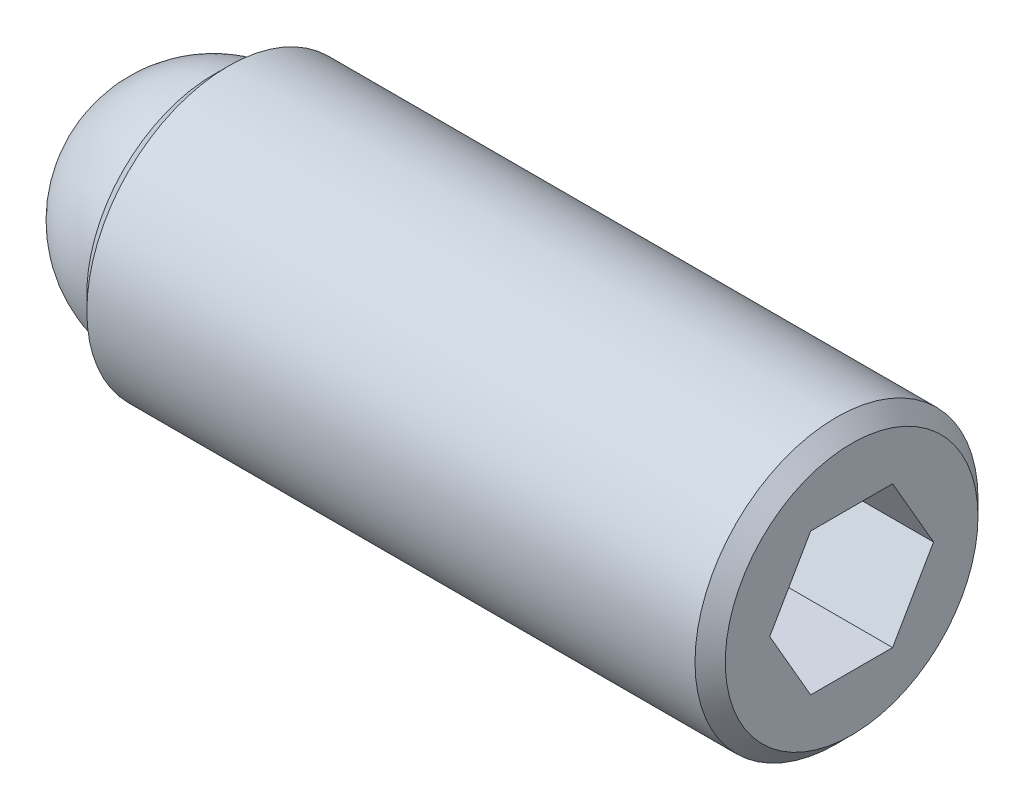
ISO-10303-21;
HEADER;
FILE_DESCRIPTION(('STEP AP214'),'2;1');
FILE_NAME('part.step','',(''),(''),'','','');
FILE_SCHEMA(('AUTOMOTIVE_DESIGN { 1 0 10303 214 1 1 1 1 }'));
ENDSEC;
DATA;
#1=APPLICATION_CONTEXT('core data for automotive mechanical design processes');
#2=APPLICATION_PROTOCOL_DEFINITION('international standard','automotive_design',2000,#1);
#3=PRODUCT_CONTEXT('',#1,'mechanical');
#4=PRODUCT('Part','Part','',(#3));
#5=PRODUCT_RELATED_PRODUCT_CATEGORY('part','',(#4));
#6=PRODUCT_DEFINITION_FORMATION('','',#4);
#7=PRODUCT_DEFINITION_CONTEXT('part definition',#1,'design');
#8=PRODUCT_DEFINITION('design','',#6,#7);
#9=PRODUCT_DEFINITION_SHAPE('','',#8);
#10=(LENGTH_UNIT() NAMED_UNIT(*) SI_UNIT(.MILLI.,.METRE.));
#11=(NAMED_UNIT(*) PLANE_ANGLE_UNIT() SI_UNIT($,.RADIAN.));
#12=(NAMED_UNIT(*) SI_UNIT($,.STERADIAN.) SOLID_ANGLE_UNIT());
#13=UNCERTAINTY_MEASURE_WITH_UNIT(LENGTH_MEASURE(1.E-05),#10,'distance_accuracy_value','');
#14=(GEOMETRIC_REPRESENTATION_CONTEXT(3) GLOBAL_UNCERTAINTY_ASSIGNED_CONTEXT((#13)) GLOBAL_UNIT_ASSIGNED_CONTEXT((#10,
#11,#12)) REPRESENTATION_CONTEXT('',''));
#15=CARTESIAN_POINT('',(0.,0.,0.));
#16=DIRECTION('',(0.,0.,1.));
#17=DIRECTION('',(1.,0.,0.));
#18=AXIS2_PLACEMENT_3D('',#15,#16,#17);
#19=CARTESIAN_POINT('',(0.,0.,0.));
#20=DIRECTION('',(0.,-1.,0.));
#21=DIRECTION('',(0.,0.,1.));
#22=AXIS2_PLACEMENT_3D('',#19,#20,#21);
#23=SPHERICAL_SURFACE('',#22,1.984375);
#24=CARTESIAN_POINT('',(0.,-1.984375,0.));
#25=VERTEX_POINT('',#24);
#26=VERTEX_LOOP('',#25);
#27=FACE_BOUND('',#26,.T.);
#28=ADVANCED_FACE('F41',(#27),#23,.T.);
#29=CLOSED_SHELL('',(#28));
#30=MANIFOLD_SOLID_BREP('B2',#29);
#31=CARTESIAN_POINT('',(10.715625,0.,0.));
#32=DIRECTION('',(-1.,0.,0.));
#33=DIRECTION('',(0.,0.,1.));
#34=AXIS2_PLACEMENT_3D('',#31,#32,#33);
#35=CYLINDRICAL_SURFACE('',#34,2.3749);
#36=CARTESIAN_POINT('',(10.461625,0.,0.));
#37=DIRECTION('',(1.,0.,0.));
#38=DIRECTION('',(0.,0.,-1.));
#39=AXIS2_PLACEMENT_3D('',#36,#37,#38);
#40=CIRCLE('',#39,2.3749);
#41=CARTESIAN_POINT('',(10.461625,0.,-2.3749));
#42=VERTEX_POINT('',#41);
#43=EDGE_CURVE('E39',#42,#42,#40,.F.);
#44=ORIENTED_EDGE('',*,*,#43,.T.);
#45=EDGE_LOOP('',(#44));
#46=FACE_BOUND('',#45,.T.);
#47=CARTESIAN_POINT('',(0.254000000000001,0.,0.));
#48=DIRECTION('',(1.,0.,0.));
#49=DIRECTION('',(0.,0.,-1.));
#50=AXIS2_PLACEMENT_3D('',#47,#48,#49);
#51=CIRCLE('',#50,2.3749);
#52=CARTESIAN_POINT('',(0.254000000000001,0.,-2.3749));
#53=VERTEX_POINT('',#52);
#54=EDGE_CURVE('E157',#53,#53,#51,.T.);
#55=ORIENTED_EDGE('',*,*,#54,.T.);
#56=EDGE_LOOP('',(#55));
#57=FACE_BOUND('',#56,.T.);
#58=ADVANCED_FACE('F54',(#46,#57),#35,.T.);
#59=CARTESIAN_POINT('',(10.715625,0.,0.));
#60=DIRECTION('',(1.,0.,0.));
#61=DIRECTION('',(0.,0.,-1.));
#62=AXIS2_PLACEMENT_3D('',#59,#60,#61);
#63=PLANE('',#62);
#64=DIRECTION('',(0.,0.866025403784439,-0.5));
#65=VECTOR('',#64,1.);
#66=CARTESIAN_POINT('',(10.715625,-1.190625,-0.687407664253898));
#67=LINE('',#66,#65);
#68=CARTESIAN_POINT('',(10.715625,-1.190625,-0.687407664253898));
#69=VERTEX_POINT('',#68);
#70=CARTESIAN_POINT('',(10.715625,0.,-1.3748153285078));
#71=VERTEX_POINT('',#70);
#72=EDGE_CURVE('E69',#69,#71,#67,.T.);
#73=ORIENTED_EDGE('',*,*,#72,.F.);
#74=DIRECTION('',(0.,0.,-1.));
#75=VECTOR('',#74,1.);
#76=CARTESIAN_POINT('',(10.715625,-1.190625,0.687407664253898));
#77=LINE('',#76,#75);
#78=CARTESIAN_POINT('',(10.715625,-1.190625,0.687407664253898));
#79=VERTEX_POINT('',#78);
#80=EDGE_CURVE('E153',#79,#69,#77,.T.);
#81=ORIENTED_EDGE('',*,*,#80,.F.);
#82=DIRECTION('',(0.,-0.866025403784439,-0.5));
#83=VECTOR('',#82,1.);
#84=CARTESIAN_POINT('',(10.715625,0.,1.3748153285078));
#85=LINE('',#84,#83);
#86=CARTESIAN_POINT('',(10.715625,0.,1.3748153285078));
#87=VERTEX_POINT('',#86);
#88=EDGE_CURVE('E151',#87,#79,#85,.T.);
#89=ORIENTED_EDGE('',*,*,#88,.F.);
#90=DIRECTION('',(0.,-0.866025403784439,0.5));
#91=VECTOR('',#90,1.);
#92=CARTESIAN_POINT('',(10.715625,1.190625,0.687407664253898));
#93=LINE('',#92,#91);
#94=CARTESIAN_POINT('',(10.715625,1.190625,0.687407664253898));
#95=VERTEX_POINT('',#94);
#96=EDGE_CURVE('E117',#95,#87,#93,.T.);
#97=ORIENTED_EDGE('',*,*,#96,.F.);
#98=DIRECTION('',(0.,0.,1.));
#99=VECTOR('',#98,1.);
#100=CARTESIAN_POINT('',(10.715625,1.190625,-0.687407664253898));
#101=LINE('',#100,#99);
#102=CARTESIAN_POINT('',(10.715625,1.190625,-0.687407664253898));
#103=VERTEX_POINT('',#102);
#104=EDGE_CURVE('E147',#103,#95,#101,.T.);
#105=ORIENTED_EDGE('',*,*,#104,.F.);
#106=DIRECTION('',(0.,0.866025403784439,0.5));
#107=VECTOR('',#106,1.);
#108=CARTESIAN_POINT('',(10.715625,0.,-1.3748153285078));
#109=LINE('',#108,#107);
#110=EDGE_CURVE('E143',#71,#103,#109,.T.);
#111=ORIENTED_EDGE('',*,*,#110,.F.);
#112=EDGE_LOOP('',(#73,#81,#89,#97,#105,#111));
#113=FACE_BOUND('',#112,.T.);
#114=CARTESIAN_POINT('',(10.715625,0.,0.));
#115=DIRECTION('',(1.,0.,0.));
#116=DIRECTION('',(0.,0.,-1.));
#117=AXIS2_PLACEMENT_3D('',#114,#115,#116);
#118=CIRCLE('',#117,2.1209);
#119=CARTESIAN_POINT('',(10.715625,0.,-2.1209));
#120=VERTEX_POINT('',#119);
#121=EDGE_CURVE('E62',#120,#120,#118,.T.);
#122=ORIENTED_EDGE('',*,*,#121,.T.);
#123=EDGE_LOOP('',(#122));
#124=FACE_BOUND('',#123,.T.);
#125=ADVANCED_FACE('F170',(#113,#124),#63,.T.);
#126=CARTESIAN_POINT('',(0.,0.,0.));
#127=DIRECTION('',(1.,0.,0.));
#128=DIRECTION('',(0.,0.,-1.));
#129=AXIS2_PLACEMENT_3D('',#126,#127,#128);
#130=PLANE('',#129);
#131=CARTESIAN_POINT('',(0.,0.,0.));
#132=DIRECTION('',(-1.,0.,0.));
#133=DIRECTION('',(0.,0.,1.));
#134=AXIS2_PLACEMENT_3D('',#131,#132,#133);
#135=CIRCLE('',#134,1.9812);
#136=CARTESIAN_POINT('',(0.,0.,1.9812));
#137=VERTEX_POINT('',#136);
#138=EDGE_CURVE('E225',#137,#137,#135,.T.);
#139=ORIENTED_EDGE('',*,*,#138,.F.);
#140=EDGE_LOOP('',(#139));
#141=FACE_BOUND('',#140,.T.);
#142=CARTESIAN_POINT('',(0.,0.,0.));
#143=DIRECTION('',(1.,0.,0.));
#144=DIRECTION('',(0.,0.,-1.));
#145=AXIS2_PLACEMENT_3D('',#142,#143,#144);
#146=CIRCLE('',#145,2.1209);
#147=CARTESIAN_POINT('',(0.,0.,-2.1209));
#148=VERTEX_POINT('',#147);
#149=EDGE_CURVE('E165',#148,#148,#146,.F.);
#150=ORIENTED_EDGE('',*,*,#149,.T.);
#151=EDGE_LOOP('',(#150));
#152=FACE_BOUND('',#151,.T.);
#153=ADVANCED_FACE('F182',(#141,#152),#130,.F.);
#154=CARTESIAN_POINT('',(0.254000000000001,0.,0.));
#155=DIRECTION('',(1.,0.,0.));
#156=DIRECTION('',(0.,0.,-1.));
#157=AXIS2_PLACEMENT_3D('',#154,#155,#156);
#158=CONICAL_SURFACE('',#157,2.3749,0.78539816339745);
#159=ORIENTED_EDGE('',*,*,#149,.F.);
#160=EDGE_LOOP('',(#159));
#161=FACE_BOUND('',#160,.T.);
#162=ORIENTED_EDGE('',*,*,#54,.F.);
#163=EDGE_LOOP('',(#162));
#164=FACE_BOUND('',#163,.T.);
#165=ADVANCED_FACE('F174',(#161,#164),#158,.T.);
#166=CARTESIAN_POINT('',(10.715625,0.,0.));
#167=DIRECTION('',(-1.,0.,0.));
#168=DIRECTION('',(0.,0.,1.));
#169=AXIS2_PLACEMENT_3D('',#166,#167,#168);
#170=CONICAL_SURFACE('',#169,2.1209,0.785398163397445);
#171=ORIENTED_EDGE('',*,*,#43,.F.);
#172=EDGE_LOOP('',(#171));
#173=FACE_BOUND('',#172,.T.);
#174=ORIENTED_EDGE('',*,*,#121,.F.);
#175=EDGE_LOOP('',(#174));
#176=FACE_BOUND('',#175,.T.);
#177=ADVANCED_FACE('F56',(#173,#176),#170,.T.);
#178=CARTESIAN_POINT('',(8.429625,-1.190625,-0.687407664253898));
#179=DIRECTION('',(0.,-0.5,-0.866025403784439));
#180=DIRECTION('',(0.,0.866025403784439,-0.5));
#181=AXIS2_PLACEMENT_3D('',#178,#179,#180);
#182=PLANE('',#181);
#183=ORIENTED_EDGE('',*,*,#72,.T.);
#184=DIRECTION('',(1.,0.,0.));
#185=VECTOR('',#184,1.);
#186=CARTESIAN_POINT('',(8.429625,0.,-1.3748153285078));
#187=LINE('',#186,#185);
#188=CARTESIAN_POINT('',(8.429625,0.,-1.3748153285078));
#189=VERTEX_POINT('',#188);
#190=EDGE_CURVE('E99',#189,#71,#187,.T.);
#191=ORIENTED_EDGE('',*,*,#190,.F.);
#192=DIRECTION('',(0.,0.866025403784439,-0.5));
#193=VECTOR('',#192,1.);
#194=CARTESIAN_POINT('',(8.429625,-1.190625,-0.687407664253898));
#195=LINE('',#194,#193);
#196=CARTESIAN_POINT('',(8.429625,-1.190625,-0.687407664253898));
#197=VERTEX_POINT('',#196);
#198=EDGE_CURVE('E155',#197,#189,#195,.T.);
#199=ORIENTED_EDGE('',*,*,#198,.F.);
#200=DIRECTION('',(1.,0.,0.));
#201=VECTOR('',#200,1.);
#202=CARTESIAN_POINT('',(8.429625,-1.190625,-0.687407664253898));
#203=LINE('',#202,#201);
#204=EDGE_CURVE('E77',#197,#69,#203,.T.);
#205=ORIENTED_EDGE('',*,*,#204,.T.);
#206=EDGE_LOOP('',(#183,#191,#199,#205));
#207=FACE_BOUND('',#206,.T.);
#208=ADVANCED_FACE('F173',(#207),#182,.F.);
#209=CARTESIAN_POINT('',(8.429625,-1.190625,0.687407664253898));
#210=DIRECTION('',(0.,-1.,0.));
#211=DIRECTION('',(0.,0.,-1.));
#212=AXIS2_PLACEMENT_3D('',#209,#210,#211);
#213=PLANE('',#212);
#214=ORIENTED_EDGE('',*,*,#80,.T.);
#215=ORIENTED_EDGE('',*,*,#204,.F.);
#216=DIRECTION('',(0.,0.,-1.));
#217=VECTOR('',#216,1.);
#218=CARTESIAN_POINT('',(8.429625,-1.190625,0.687407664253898));
#219=LINE('',#218,#217);
#220=CARTESIAN_POINT('',(8.429625,-1.190625,0.687407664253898));
#221=VERTEX_POINT('',#220);
#222=EDGE_CURVE('E129',#221,#197,#219,.T.);
#223=ORIENTED_EDGE('',*,*,#222,.F.);
#224=DIRECTION('',(1.,0.,0.));
#225=VECTOR('',#224,1.);
#226=CARTESIAN_POINT('',(8.429625,-1.190625,0.687407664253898));
#227=LINE('',#226,#225);
#228=EDGE_CURVE('E121',#221,#79,#227,.T.);
#229=ORIENTED_EDGE('',*,*,#228,.T.);
#230=EDGE_LOOP('',(#214,#215,#223,#229));
#231=FACE_BOUND('',#230,.T.);
#232=ADVANCED_FACE('F180',(#231),#213,.F.);
#233=CARTESIAN_POINT('',(8.429625,0.,1.3748153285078));
#234=DIRECTION('',(0.,-0.5,0.866025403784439));
#235=DIRECTION('',(0.,-0.866025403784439,-0.5));
#236=AXIS2_PLACEMENT_3D('',#233,#234,#235);
#237=PLANE('',#236);
#238=ORIENTED_EDGE('',*,*,#88,.T.);
#239=ORIENTED_EDGE('',*,*,#228,.F.);
#240=DIRECTION('',(0.,-0.866025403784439,-0.5));
#241=VECTOR('',#240,1.);
#242=CARTESIAN_POINT('',(8.429625,0.,1.3748153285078));
#243=LINE('',#242,#241);
#244=CARTESIAN_POINT('',(8.429625,0.,1.3748153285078));
#245=VERTEX_POINT('',#244);
#246=EDGE_CURVE('E125',#245,#221,#243,.T.);
#247=ORIENTED_EDGE('',*,*,#246,.F.);
#248=DIRECTION('',(1.,0.,0.));
#249=VECTOR('',#248,1.);
#250=CARTESIAN_POINT('',(8.429625,0.,1.3748153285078));
#251=LINE('',#250,#249);
#252=EDGE_CURVE('E110',#245,#87,#251,.T.);
#253=ORIENTED_EDGE('',*,*,#252,.T.);
#254=EDGE_LOOP('',(#238,#239,#247,#253));
#255=FACE_BOUND('',#254,.T.);
#256=ADVANCED_FACE('F126',(#255),#237,.F.);
#257=CARTESIAN_POINT('',(8.429625,1.190625,0.687407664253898));
#258=DIRECTION('',(0.,0.5,0.866025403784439));
#259=DIRECTION('',(0.,-0.866025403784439,0.5));
#260=AXIS2_PLACEMENT_3D('',#257,#258,#259);
#261=PLANE('',#260);
#262=ORIENTED_EDGE('',*,*,#96,.T.);
#263=ORIENTED_EDGE('',*,*,#252,.F.);
#264=DIRECTION('',(0.,-0.866025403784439,0.5));
#265=VECTOR('',#264,1.);
#266=CARTESIAN_POINT('',(8.429625,1.190625,0.687407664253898));
#267=LINE('',#266,#265);
#268=CARTESIAN_POINT('',(8.429625,1.190625,0.687407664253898));
#269=VERTEX_POINT('',#268);
#270=EDGE_CURVE('E114',#269,#245,#267,.T.);
#271=ORIENTED_EDGE('',*,*,#270,.F.);
#272=DIRECTION('',(1.,0.,0.));
#273=VECTOR('',#272,1.);
#274=CARTESIAN_POINT('',(8.429625,1.190625,0.687407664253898));
#275=LINE('',#274,#273);
#276=EDGE_CURVE('E122',#269,#95,#275,.T.);
#277=ORIENTED_EDGE('',*,*,#276,.T.);
#278=EDGE_LOOP('',(#262,#263,#271,#277));
#279=FACE_BOUND('',#278,.T.);
#280=ADVANCED_FACE('F112',(#279),#261,.F.);
#281=CARTESIAN_POINT('',(8.429625,1.190625,-0.687407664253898));
#282=DIRECTION('',(0.,1.,0.));
#283=DIRECTION('',(0.,0.,1.));
#284=AXIS2_PLACEMENT_3D('',#281,#282,#283);
#285=PLANE('',#284);
#286=ORIENTED_EDGE('',*,*,#104,.T.);
#287=ORIENTED_EDGE('',*,*,#276,.F.);
#288=DIRECTION('',(0.,0.,1.));
#289=VECTOR('',#288,1.);
#290=CARTESIAN_POINT('',(8.429625,1.190625,-0.687407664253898));
#291=LINE('',#290,#289);
#292=CARTESIAN_POINT('',(8.429625,1.190625,-0.687407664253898));
#293=VERTEX_POINT('',#292);
#294=EDGE_CURVE('E135',#293,#269,#291,.T.);
#295=ORIENTED_EDGE('',*,*,#294,.F.);
#296=DIRECTION('',(1.,0.,0.));
#297=VECTOR('',#296,1.);
#298=CARTESIAN_POINT('',(8.429625,1.190625,-0.687407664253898));
#299=LINE('',#298,#297);
#300=EDGE_CURVE('E160',#293,#103,#299,.T.);
#301=ORIENTED_EDGE('',*,*,#300,.T.);
#302=EDGE_LOOP('',(#286,#287,#295,#301));
#303=FACE_BOUND('',#302,.T.);
#304=ADVANCED_FACE('F201',(#303),#285,.F.);
#305=CARTESIAN_POINT('',(8.429625,0.,-1.3748153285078));
#306=DIRECTION('',(0.,0.5,-0.866025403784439));
#307=DIRECTION('',(0.,0.866025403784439,0.5));
#308=AXIS2_PLACEMENT_3D('',#305,#306,#307);
#309=PLANE('',#308);
#310=ORIENTED_EDGE('',*,*,#110,.T.);
#311=ORIENTED_EDGE('',*,*,#300,.F.);
#312=DIRECTION('',(0.,0.866025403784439,0.5));
#313=VECTOR('',#312,1.);
#314=CARTESIAN_POINT('',(8.429625,0.,-1.3748153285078));
#315=LINE('',#314,#313);
#316=EDGE_CURVE('E137',#189,#293,#315,.T.);
#317=ORIENTED_EDGE('',*,*,#316,.F.);
#318=ORIENTED_EDGE('',*,*,#190,.T.);
#319=EDGE_LOOP('',(#310,#311,#317,#318));
#320=FACE_BOUND('',#319,.T.);
#321=ADVANCED_FACE('F198',(#320),#309,.F.);
#322=CARTESIAN_POINT('',(8.429625,0.,0.));
#323=DIRECTION('',(1.,0.,0.));
#324=DIRECTION('',(0.,0.,-1.));
#325=AXIS2_PLACEMENT_3D('',#322,#323,#324);
#326=PLANE('',#325);
#327=ORIENTED_EDGE('',*,*,#198,.T.);
#328=ORIENTED_EDGE('',*,*,#316,.T.);
#329=ORIENTED_EDGE('',*,*,#294,.T.);
#330=ORIENTED_EDGE('',*,*,#270,.T.);
#331=ORIENTED_EDGE('',*,*,#246,.T.);
#332=ORIENTED_EDGE('',*,*,#222,.T.);
#333=EDGE_LOOP('',(#327,#328,#329,#330,#331,#332));
#334=FACE_BOUND('',#333,.T.);
#335=ADVANCED_FACE('F132',(#334),#326,.T.);
#336=CARTESIAN_POINT('',(1.984375,0.,0.));
#337=DIRECTION('',(-1.,0.,0.));
#338=DIRECTION('',(0.,0.,1.));
#339=AXIS2_PLACEMENT_3D('',#336,#337,#338);
#340=CYLINDRICAL_SURFACE('',#339,1.9812);
#341=CARTESIAN_POINT('',(1.984375,0.,0.));
#342=DIRECTION('',(-1.,0.,0.));
#343=DIRECTION('',(0.,0.,1.));
#344=AXIS2_PLACEMENT_3D('',#341,#342,#343);
#345=CIRCLE('',#344,1.9812);
#346=CARTESIAN_POINT('',(1.984375,0.,1.9812));
#347=VERTEX_POINT('',#346);
#348=EDGE_CURVE('E144',#347,#347,#345,.T.);
#349=ORIENTED_EDGE('',*,*,#348,.F.);
#350=EDGE_LOOP('',(#349));
#351=FACE_BOUND('',#350,.T.);
#352=ORIENTED_EDGE('',*,*,#138,.T.);
#353=EDGE_LOOP('',(#352));
#354=FACE_BOUND('',#353,.T.);
#355=ADVANCED_FACE('F214',(#351,#354),#340,.F.);
#356=CARTESIAN_POINT('',(1.984375,0.,0.));
#357=DIRECTION('',(-1.,0.,0.));
#358=DIRECTION('',(0.,0.,1.));
#359=AXIS2_PLACEMENT_3D('',#356,#357,#358);
#360=PLANE('',#359);
#361=ORIENTED_EDGE('',*,*,#348,.T.);
#362=EDGE_LOOP('',(#361));
#363=FACE_BOUND('',#362,.T.);
#364=ADVANCED_FACE('F217',(#363),#360,.T.);
#365=CLOSED_SHELL('',(#58,#125,#153,#165,#177,#208,#232,#256,#280,#304,#321,#335,#355,#364));
#366=MANIFOLD_SOLID_BREP('B6',#365);
#367=ADVANCED_BREP_SHAPE_REPRESENTATION('',(#18,#30,#366),#14);
#368=SHAPE_DEFINITION_REPRESENTATION(#9,#367);
ENDSEC;
END-ISO-10303-21;
